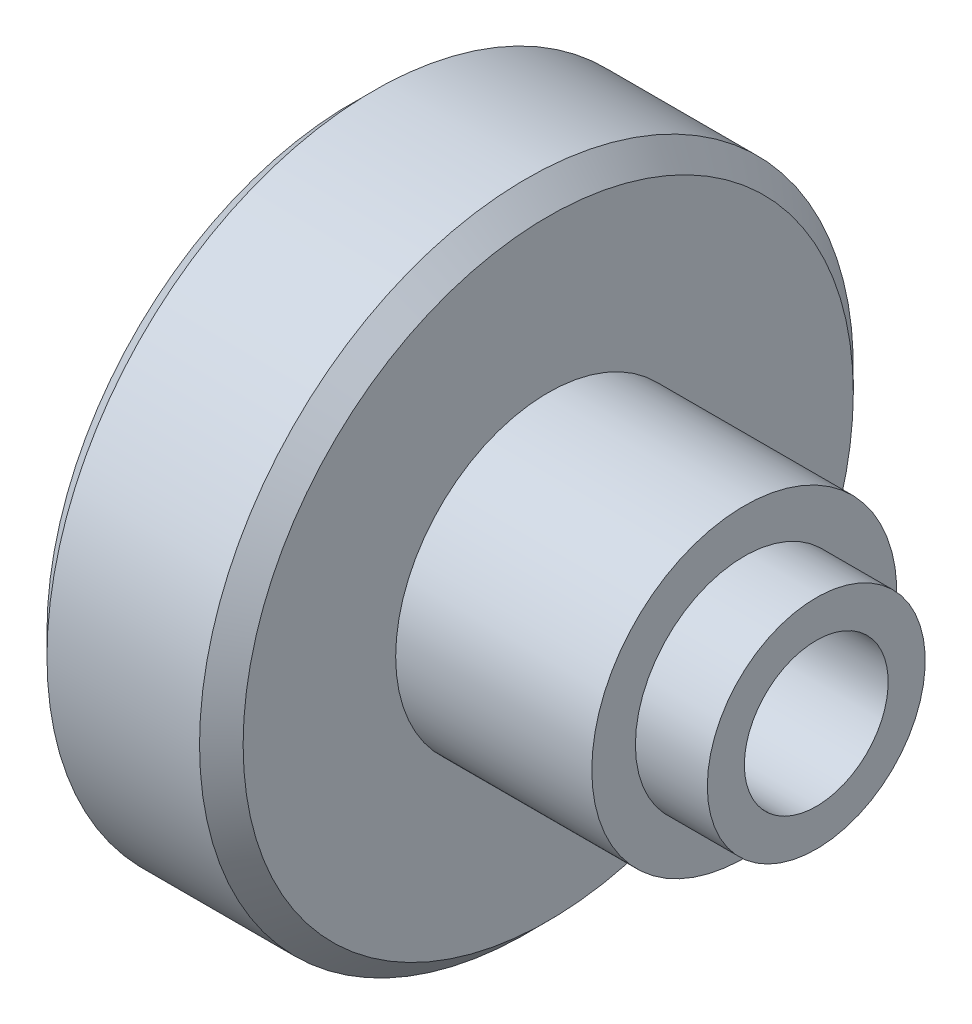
from build123d import *

# Parameters (mm, degrees)
CHAMFER1_SIZE = 1


with BuildPart() as part:
    # Sketch1 → Revolve1 (revolve)
    with BuildSketch(Plane.XY, mode=Mode.PRIVATE) as revolve1_sk:
        Polygon((0, 6.3), (0, 15), (9, 15), (9, 7), (18, 7), (18, 5), (21.3, 5), (21.3, 3.3), (3, 3.3), align=None)
    revolve(revolve1_sk.sketch.rotate(Axis((0, 0, 0), (1, 0, 0)), 90), axis=Axis((0, 0, 0), (1, 0, 0)))

    # Chamfer1
    chamfer1_edges = [part.edges().sort_by_distance(p)[0] for p in [
        (9, 0, -15),
        (0, 0, -15),
    ]]
    chamfer(chamfer1_edges, length=CHAMFER1_SIZE)


solid = part.part
